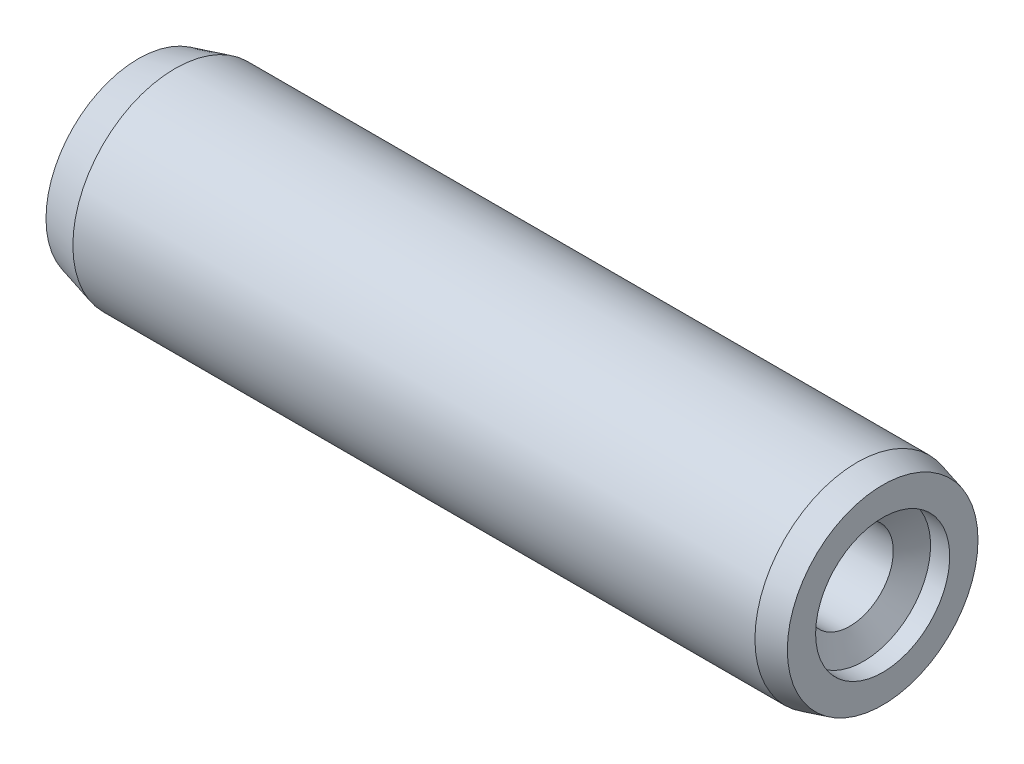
ISO-10303-21;
HEADER;
FILE_DESCRIPTION(('STEP AP214'),'2;1');
FILE_NAME('part.step','',(''),(''),'','','');
FILE_SCHEMA(('AUTOMOTIVE_DESIGN { 1 0 10303 214 1 1 1 1 }'));
ENDSEC;
DATA;
#1=APPLICATION_CONTEXT('core data for automotive mechanical design processes');
#2=APPLICATION_PROTOCOL_DEFINITION('international standard','automotive_design',2000,#1);
#3=PRODUCT_CONTEXT('',#1,'mechanical');
#4=PRODUCT('Part','Part','',(#3));
#5=PRODUCT_RELATED_PRODUCT_CATEGORY('part','',(#4));
#6=PRODUCT_DEFINITION_FORMATION('','',#4);
#7=PRODUCT_DEFINITION_CONTEXT('part definition',#1,'design');
#8=PRODUCT_DEFINITION('design','',#6,#7);
#9=PRODUCT_DEFINITION_SHAPE('','',#8);
#10=(LENGTH_UNIT() NAMED_UNIT(*) SI_UNIT(.MILLI.,.METRE.));
#11=(NAMED_UNIT(*) PLANE_ANGLE_UNIT() SI_UNIT($,.RADIAN.));
#12=(NAMED_UNIT(*) SI_UNIT($,.STERADIAN.) SOLID_ANGLE_UNIT());
#13=UNCERTAINTY_MEASURE_WITH_UNIT(LENGTH_MEASURE(1.E-05),#10,'distance_accuracy_value','');
#14=(GEOMETRIC_REPRESENTATION_CONTEXT(3) GLOBAL_UNCERTAINTY_ASSIGNED_CONTEXT((#13)) GLOBAL_UNIT_ASSIGNED_CONTEXT((#10,
#11,#12)) REPRESENTATION_CONTEXT('',''));
#15=CARTESIAN_POINT('',(0.,0.,0.));
#16=DIRECTION('',(0.,0.,1.));
#17=DIRECTION('',(1.,0.,0.));
#18=AXIS2_PLACEMENT_3D('',#15,#16,#17);
#19=CARTESIAN_POINT('',(60.,7.46410161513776,0.));
#20=DIRECTION('',(-1.,0.,0.));
#21=DIRECTION('',(0.,0.,1.));
#22=AXIS2_PLACEMENT_3D('',#19,#20,#21);
#23=PLANE('',#22);
#24=CARTESIAN_POINT('',(60.,0.,0.));
#25=DIRECTION('',(-1.,0.,0.));
#26=DIRECTION('',(0.,0.,1.));
#27=AXIS2_PLACEMENT_3D('',#24,#25,#26);
#28=CIRCLE('',#27,7.46410161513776);
#29=CARTESIAN_POINT('',(60.,0.,7.46410161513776));
#30=VERTEX_POINT('',#29);
#31=EDGE_CURVE('E11',#30,#30,#28,.T.);
#32=ORIENTED_EDGE('',*,*,#31,.F.);
#33=EDGE_LOOP('',(#32));
#34=FACE_BOUND('',#33,.T.);
#35=CARTESIAN_POINT('',(60.,0.,0.));
#36=DIRECTION('',(-1.,0.,0.));
#37=DIRECTION('',(0.,0.,1.));
#38=AXIS2_PLACEMENT_3D('',#35,#36,#37);
#39=CIRCLE('',#38,5.25);
#40=CARTESIAN_POINT('',(60.,0.,5.25));
#41=VERTEX_POINT('',#40);
#42=EDGE_CURVE('E78',#41,#41,#39,.T.);
#43=ORIENTED_EDGE('',*,*,#42,.T.);
#44=EDGE_LOOP('',(#43));
#45=FACE_BOUND('',#44,.T.);
#46=ADVANCED_FACE('F41',(#34,#45),#23,.F.);
#47=CARTESIAN_POINT('',(60.,0.,0.));
#48=DIRECTION('',(-1.,0.,0.));
#49=DIRECTION('',(0.,0.,1.));
#50=AXIS2_PLACEMENT_3D('',#47,#48,#49);
#51=CONICAL_SURFACE('',#50,7.46410161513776,0.261799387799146);
#52=CARTESIAN_POINT('',(58.,0.,0.));
#53=DIRECTION('',(-1.,0.,0.));
#54=DIRECTION('',(0.,0.,1.));
#55=AXIS2_PLACEMENT_3D('',#52,#53,#54);
#56=CIRCLE('',#55,8.);
#57=CARTESIAN_POINT('',(58.,0.,8.));
#58=VERTEX_POINT('',#57);
#59=EDGE_CURVE('E50',#58,#58,#56,.T.);
#60=ORIENTED_EDGE('',*,*,#59,.F.);
#61=EDGE_LOOP('',(#60));
#62=FACE_BOUND('',#61,.T.);
#63=ORIENTED_EDGE('',*,*,#31,.T.);
#64=EDGE_LOOP('',(#63));
#65=FACE_BOUND('',#64,.T.);
#66=ADVANCED_FACE('F70',(#62,#65),#51,.T.);
#67=CARTESIAN_POINT('',(0.,0.,0.));
#68=DIRECTION('',(-1.,0.,0.));
#69=DIRECTION('',(0.,0.,1.));
#70=AXIS2_PLACEMENT_3D('',#67,#68,#69);
#71=CYLINDRICAL_SURFACE('',#70,8.);
#72=CARTESIAN_POINT('',(4.6,0.,0.));
#73=DIRECTION('',(-1.,0.,0.));
#74=DIRECTION('',(0.,0.,1.));
#75=AXIS2_PLACEMENT_3D('',#72,#73,#74);
#76=CIRCLE('',#75,8.);
#77=CARTESIAN_POINT('',(4.6,0.,8.));
#78=VERTEX_POINT('',#77);
#79=EDGE_CURVE('E98',#78,#78,#76,.T.);
#80=ORIENTED_EDGE('',*,*,#79,.F.);
#81=EDGE_LOOP('',(#80));
#82=FACE_BOUND('',#81,.T.);
#83=ORIENTED_EDGE('',*,*,#59,.T.);
#84=EDGE_LOOP('',(#83));
#85=FACE_BOUND('',#84,.T.);
#86=ADVANCED_FACE('F71',(#82,#85),#71,.T.);
#87=CARTESIAN_POINT('',(4.6,0.,0.));
#88=DIRECTION('',(1.,0.,0.));
#89=DIRECTION('',(0.,0.,-1.));
#90=AXIS2_PLACEMENT_3D('',#87,#88,#89);
#91=CONICAL_SURFACE('',#90,8.,0.261799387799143);
#92=CARTESIAN_POINT('',(1.72675925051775,0.,0.));
#93=DIRECTION('',(-1.,0.,0.));
#94=DIRECTION('',(0.,0.,1.));
#95=AXIS2_PLACEMENT_3D('',#92,#93,#94);
#96=CIRCLE('',#95,7.23011746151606);
#97=CARTESIAN_POINT('',(1.72675925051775,0.,7.23011746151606));
#98=VERTEX_POINT('',#97);
#99=EDGE_CURVE('E95',#98,#98,#96,.T.);
#100=ORIENTED_EDGE('',*,*,#99,.F.);
#101=EDGE_LOOP('',(#100));
#102=FACE_BOUND('',#101,.T.);
#103=ORIENTED_EDGE('',*,*,#79,.T.);
#104=EDGE_LOOP('',(#103));
#105=FACE_BOUND('',#104,.T.);
#106=ADVANCED_FACE('F61',(#102,#105),#91,.T.);
#107=CARTESIAN_POINT('',(16.,0.,0.));
#108=DIRECTION('',(-1.,0.,0.));
#109=DIRECTION('',(0.,1.,0.));
#110=AXIS2_PLACEMENT_3D('',#107,#108,#109);
#111=SPHERICAL_SURFACE('',#110,16.);
#112=ORIENTED_EDGE('',*,*,#99,.T.);
#113=EDGE_LOOP('',(#112));
#114=FACE_BOUND('',#113,.T.);
#115=ADVANCED_FACE('F52',(#114),#111,.T.);
#116=CARTESIAN_POINT('',(33.5916738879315,0.,0.));
#117=DIRECTION('',(1.,0.,0.));
#118=DIRECTION('',(0.,0.,-1.));
#119=AXIS2_PLACEMENT_3D('',#116,#117,#118);
#120=CONICAL_SURFACE('',#119,0.,1.17809724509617);
#121=CARTESIAN_POINT('',(35.,0.,0.));
#122=DIRECTION('',(-1.,0.,0.));
#123=DIRECTION('',(0.,0.,1.));
#124=AXIS2_PLACEMENT_3D('',#121,#122,#123);
#125=CIRCLE('',#124,3.4);
#126=CARTESIAN_POINT('',(35.,0.,3.4));
#127=VERTEX_POINT('',#126);
#128=EDGE_CURVE('E86',#127,#127,#125,.T.);
#129=ORIENTED_EDGE('',*,*,#128,.F.);
#130=EDGE_LOOP('',(#129));
#131=FACE_BOUND('',#130,.T.);
#132=CARTESIAN_POINT('',(33.5916738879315,0.,0.));
#133=VERTEX_POINT('',#132);
#134=VERTEX_LOOP('',#133);
#135=FACE_BOUND('',#134,.T.);
#136=ADVANCED_FACE('F49',(#131,#135),#120,.F.);
#137=CARTESIAN_POINT('',(0.,0.,0.));
#138=DIRECTION('',(-1.,0.,0.));
#139=DIRECTION('',(0.,0.,1.));
#140=AXIS2_PLACEMENT_3D('',#137,#138,#139);
#141=CYLINDRICAL_SURFACE('',#140,3.4);
#142=CARTESIAN_POINT('',(57.4319020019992,0.,0.));
#143=DIRECTION('',(-1.,0.,0.));
#144=DIRECTION('',(0.,0.,1.));
#145=AXIS2_PLACEMENT_3D('',#142,#143,#144);
#146=CIRCLE('',#145,3.4);
#147=CARTESIAN_POINT('',(57.4319020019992,0.,3.4));
#148=VERTEX_POINT('',#147);
#149=EDGE_CURVE('E83',#148,#148,#146,.T.);
#150=ORIENTED_EDGE('',*,*,#149,.F.);
#151=EDGE_LOOP('',(#150));
#152=FACE_BOUND('',#151,.T.);
#153=ORIENTED_EDGE('',*,*,#128,.T.);
#154=EDGE_LOOP('',(#153));
#155=FACE_BOUND('',#154,.T.);
#156=ADVANCED_FACE('F55',(#152,#155),#141,.F.);
#157=CARTESIAN_POINT('',(57.4319020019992,0.,0.));
#158=DIRECTION('',(1.,0.,0.));
#159=DIRECTION('',(0.,0.,-1.));
#160=AXIS2_PLACEMENT_3D('',#157,#158,#159);
#161=CONICAL_SURFACE('',#160,3.4,1.0471975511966);
#162=CARTESIAN_POINT('',(58.5,0.,0.));
#163=DIRECTION('',(-1.,0.,0.));
#164=DIRECTION('',(0.,0.,1.));
#165=AXIS2_PLACEMENT_3D('',#162,#163,#164);
#166=CIRCLE('',#165,5.25);
#167=CARTESIAN_POINT('',(58.5,0.,5.25));
#168=VERTEX_POINT('',#167);
#169=EDGE_CURVE('E85',#168,#168,#166,.T.);
#170=ORIENTED_EDGE('',*,*,#169,.F.);
#171=EDGE_LOOP('',(#170));
#172=FACE_BOUND('',#171,.T.);
#173=ORIENTED_EDGE('',*,*,#149,.T.);
#174=EDGE_LOOP('',(#173));
#175=FACE_BOUND('',#174,.T.);
#176=ADVANCED_FACE('F62',(#172,#175),#161,.F.);
#177=CARTESIAN_POINT('',(0.,0.,0.));
#178=DIRECTION('',(-1.,0.,0.));
#179=DIRECTION('',(0.,0.,1.));
#180=AXIS2_PLACEMENT_3D('',#177,#178,#179);
#181=CYLINDRICAL_SURFACE('',#180,5.25);
#182=ORIENTED_EDGE('',*,*,#42,.F.);
#183=EDGE_LOOP('',(#182));
#184=FACE_BOUND('',#183,.T.);
#185=ORIENTED_EDGE('',*,*,#169,.T.);
#186=EDGE_LOOP('',(#185));
#187=FACE_BOUND('',#186,.T.);
#188=ADVANCED_FACE('F138',(#184,#187),#181,.F.);
#189=CLOSED_SHELL('',(#46,#66,#86,#106,#115,#136,#156,#176,#188));
#190=MANIFOLD_SOLID_BREP('B2',#189);
#191=ADVANCED_BREP_SHAPE_REPRESENTATION('',(#18,#190),#14);
#192=SHAPE_DEFINITION_REPRESENTATION(#9,#191);
ENDSEC;
END-ISO-10303-21;
